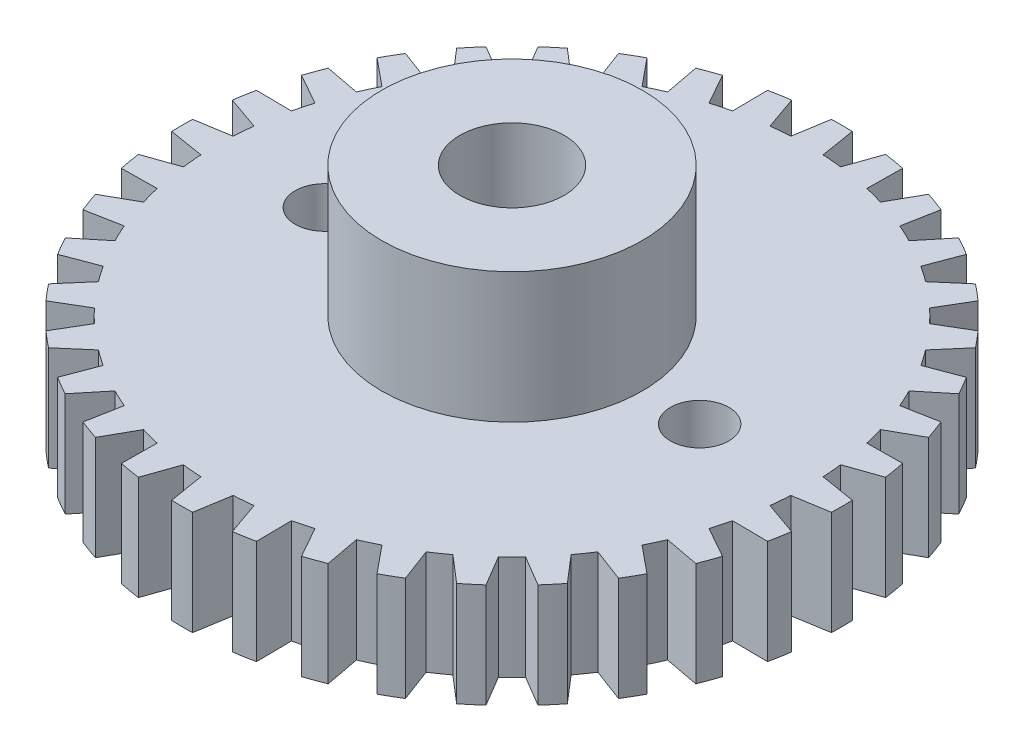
from build123d import *

# Parameters (mm, degrees)
SKETCH1_R           = 3.175
BOSS_EXTRUDE1_DEPTH = 6.35
SKETCH2_R           = 7.9375
SKETCH2_R_2         = 3.175
BOSS_EXTRUDE2_DEPTH = 7.9375
SKETCH3_R           = 1.778
CUT_EXTRUDE1_DEPTH  = 30.518698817


with BuildPart() as part:
    # Sketch1 → Boss-Extrude1 (new body)
    with BuildSketch(Plane(origin=(0, 0, 0), x_dir=(1, 0, 0), z_dir=(0, 1, 0))):
        with BuildLine():
            Line((-0.635, 20.09406907), (-0.984211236, 17.968966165))
            ThreePointArc((-0.984211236, 17.968966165), (-1.568446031, 17.927420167), (-2.151019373, 17.866883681))
            Line((-2.151019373, 17.866883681), (-2.863945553, 19.899061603))
            ThreePointArc((-2.863945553, 19.899061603), (-3.491040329, 19.798673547), (-4.114651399, 19.678528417))
            Line((-4.114651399, 19.678528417), (-4.089537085, 17.525070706))
            ThreePointArc((-4.089537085, 17.525070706), (-4.657681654, 17.382704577), (-5.220892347, 17.221924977))
            Line((-5.220892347, 17.221924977), (-6.275871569, 19.099431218))
            ThreePointArc((-6.275871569, 19.099431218), (-6.876007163, 18.891674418), (-7.469281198, 18.665065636))
            Line((-7.469281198, 18.665065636), (-7.070604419, 16.548684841))
            ThreePointArc((-7.070604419, 16.548684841), (-7.605395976, 16.309824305), (-8.13213115, 16.053686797))
            Line((-8.13213115, 16.053686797), (-9.497108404, 17.71947428))
            ThreePointArc((-9.497108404, 17.71947428), (-10.05205, 17.41066132), (-10.596960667, 17.08447428))
            Line((-10.596960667, 17.08447428), (-9.836835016, 15.069475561))
            ThreePointArc((-9.836835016, 15.069475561), (-10.322024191, 14.741378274), (-10.796279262, 14.397665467))
            Line((-10.796279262, 14.397665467), (-12.429780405, 15.801120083))
            ThreePointArc((-12.429780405, 15.801120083), (-12.922666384, 15.400634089), (-13.402656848, 14.984779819))
            Line((-13.402656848, 14.984779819), (-12.304178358, 13.132387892))
            ThreePointArc((-12.304178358, 13.132387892), (-12.725022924, 12.725022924), (-13.132387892, 12.304178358))
            Line((-13.132387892, 12.304178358), (-14.984779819, 13.402656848))
            ThreePointArc((-14.984779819, 13.402656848), (-15.400634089, 12.922666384), (-15.801120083, 12.429780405))
            Line((-15.801120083, 12.429780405), (-14.397665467, 10.796279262))
            ThreePointArc((-14.397665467, 10.796279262), (-14.741378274, 10.322024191), (-15.069475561, 9.836835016))
            Line((-15.069475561, 9.836835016), (-17.08447428, 10.596960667))
            ThreePointArc((-17.08447428, 10.596960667), (-17.41066132, 10.05205), (-17.71947428, 9.497108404))
            Line((-17.71947428, 9.497108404), (-16.053686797, 8.13213115))
            ThreePointArc((-16.053686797, 8.13213115), (-16.309824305, 7.605395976), (-16.548684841, 7.070604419))
            Line((-16.548684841, 7.070604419), (-18.665065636, 7.469281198))
            ThreePointArc((-18.665065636, 7.469281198), (-18.891674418, 6.876007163), (-19.099431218, 6.275871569))
            Line((-19.099431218, 6.275871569), (-17.221924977, 5.220892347))
            ThreePointArc((-17.221924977, 5.220892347), (-17.382704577, 4.657681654), (-17.525070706, 4.089537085))
            Line((-17.525070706, 4.089537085), (-19.678528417, 4.114651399))
            ThreePointArc((-19.678528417, 4.114651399), (-19.798673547, 3.491040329), (-19.899061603, 2.863945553))
            Line((-19.899061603, 2.863945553), (-17.866883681, 2.151019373))
            ThreePointArc((-17.866883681, 2.151019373), (-17.927420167, 1.568446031), (-17.968966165, 0.984211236))
            Line((-17.968966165, 0.984211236), (-20.09406907, 0.635))
            ThreePointArc((-20.09406907, 0.635), (-20.1041, 0), (-20.09406907, -0.635))
            Line((-20.09406907, -0.635), (-17.968966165, -0.984211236))
            ThreePointArc((-17.968966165, -0.984211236), (-17.927420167, -1.568446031), (-17.866883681, -2.151019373))
            Line((-17.866883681, -2.151019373), (-19.899061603, -2.863945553))
            ThreePointArc((-19.899061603, -2.863945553), (-19.798673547, -3.491040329), (-19.678528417, -4.114651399))
            Line((-19.678528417, -4.114651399), (-17.525070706, -4.089537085))
            ThreePointArc((-17.525070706, -4.089537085), (-17.382704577, -4.657681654), (-17.221924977, -5.220892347))
            Line((-17.221924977, -5.220892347), (-19.099431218, -6.275871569))
            ThreePointArc((-19.099431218, -6.275871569), (-18.891674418, -6.876007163), (-18.665065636, -7.469281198))
            Line((-18.665065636, -7.469281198), (-16.548684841, -7.070604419))
            ThreePointArc((-16.548684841, -7.070604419), (-16.309824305, -7.605395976), (-16.053686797, -8.13213115))
            Line((-16.053686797, -8.13213115), (-17.71947428, -9.497108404))
            ThreePointArc((-17.71947428, -9.497108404), (-17.41066132, -10.05205), (-17.08447428, -10.596960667))
            Line((-17.08447428, -10.596960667), (-15.069475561, -9.836835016))
            ThreePointArc((-15.069475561, -9.836835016), (-14.741378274, -10.322024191), (-14.397665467, -10.796279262))
            Line((-14.397665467, -10.796279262), (-15.801120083, -12.429780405))
            ThreePointArc((-15.801120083, -12.429780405), (-15.400634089, -12.922666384), (-14.984779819, -13.402656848))
            Line((-14.984779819, -13.402656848), (-13.132387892, -12.304178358))
            ThreePointArc((-13.132387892, -12.304178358), (-12.725022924, -12.725022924), (-12.304178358, -13.132387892))
            Line((-12.304178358, -13.132387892), (-13.402656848, -14.984779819))
            ThreePointArc((-13.402656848, -14.984779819), (-12.922666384, -15.400634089), (-12.429780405, -15.801120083))
            Line((-12.429780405, -15.801120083), (-10.796279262, -14.397665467))
            ThreePointArc((-10.796279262, -14.397665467), (-10.322024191, -14.741378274), (-9.836835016, -15.069475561))
            Line((-9.836835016, -15.069475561), (-10.596960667, -17.08447428))
            ThreePointArc((-10.596960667, -17.08447428), (-10.05205, -17.41066132), (-9.497108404, -17.71947428))
            Line((-9.497108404, -17.71947428), (-8.13213115, -16.053686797))
            ThreePointArc((-8.13213115, -16.053686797), (-7.605395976, -16.309824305), (-7.070604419, -16.548684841))
            Line((-7.070604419, -16.548684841), (-7.469281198, -18.665065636))
            ThreePointArc((-7.469281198, -18.665065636), (-6.876007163, -18.891674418), (-6.275871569, -19.099431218))
            Line((-6.275871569, -19.099431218), (-5.220892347, -17.221924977))
            ThreePointArc((-5.220892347, -17.221924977), (-4.657681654, -17.382704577), (-4.089537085, -17.525070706))
            Line((-4.089537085, -17.525070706), (-4.114651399, -19.678528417))
            ThreePointArc((-4.114651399, -19.678528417), (-3.491040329, -19.798673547), (-2.863945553, -19.899061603))
            Line((-2.863945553, -19.899061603), (-2.151019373, -17.866883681))
            ThreePointArc((-2.151019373, -17.866883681), (-1.568446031, -17.927420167), (-0.984211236, -17.968966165))
            Line((-0.984211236, -17.968966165), (-0.635, -20.09406907))
            ThreePointArc((-0.635, -20.09406907), (0, -20.1041), (0.635, -20.09406907))
            Line((0.635, -20.09406907), (0.984211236, -17.968966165))
            ThreePointArc((0.984211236, -17.968966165), (1.568446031, -17.927420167), (2.151019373, -17.866883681))
            Line((2.151019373, -17.866883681), (2.863945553, -19.899061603))
            ThreePointArc((2.863945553, -19.899061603), (3.491040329, -19.798673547), (4.114651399, -19.678528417))
            Line((4.114651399, -19.678528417), (4.089537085, -17.525070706))
            ThreePointArc((4.089537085, -17.525070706), (4.657681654, -17.382704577), (5.220892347, -17.221924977))
            Line((5.220892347, -17.221924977), (6.275871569, -19.099431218))
            ThreePointArc((6.275871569, -19.099431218), (6.876007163, -18.891674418), (7.469281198, -18.665065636))
            Line((7.469281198, -18.665065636), (7.070604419, -16.548684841))
            ThreePointArc((7.070604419, -16.548684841), (7.605395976, -16.309824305), (8.13213115, -16.053686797))
            Line((8.13213115, -16.053686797), (9.497108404, -17.71947428))
            ThreePointArc((9.497108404, -17.71947428), (10.05205, -17.41066132), (10.596960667, -17.08447428))
            Line((10.596960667, -17.08447428), (9.836835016, -15.069475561))
            ThreePointArc((9.836835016, -15.069475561), (10.322024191, -14.741378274), (10.796279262, -14.397665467))
            Line((10.796279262, -14.397665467), (12.429780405, -15.801120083))
            ThreePointArc((12.429780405, -15.801120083), (12.922666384, -15.400634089), (13.402656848, -14.984779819))
            Line((13.402656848, -14.984779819), (12.304178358, -13.132387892))
            ThreePointArc((12.304178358, -13.132387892), (12.725022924, -12.725022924), (13.132387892, -12.304178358))
            Line((13.132387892, -12.304178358), (14.984779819, -13.402656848))
            ThreePointArc((14.984779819, -13.402656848), (15.400634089, -12.922666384), (15.801120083, -12.429780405))
            Line((15.801120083, -12.429780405), (14.397665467, -10.796279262))
            ThreePointArc((14.397665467, -10.796279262), (14.741378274, -10.322024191), (15.069475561, -9.836835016))
            Line((15.069475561, -9.836835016), (17.08447428, -10.596960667))
            ThreePointArc((17.08447428, -10.596960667), (17.41066132, -10.05205), (17.71947428, -9.497108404))
            Line((17.71947428, -9.497108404), (16.053686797, -8.13213115))
            ThreePointArc((16.053686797, -8.13213115), (16.309824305, -7.605395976), (16.548684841, -7.070604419))
            Line((16.548684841, -7.070604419), (18.665065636, -7.469281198))
            ThreePointArc((18.665065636, -7.469281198), (18.891674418, -6.876007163), (19.099431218, -6.275871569))
            Line((19.099431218, -6.275871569), (17.221924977, -5.220892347))
            ThreePointArc((17.221924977, -5.220892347), (17.382704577, -4.657681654), (17.525070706, -4.089537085))
            Line((17.525070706, -4.089537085), (19.678528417, -4.114651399))
            ThreePointArc((19.678528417, -4.114651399), (19.798673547, -3.491040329), (19.899061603, -2.863945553))
            Line((19.899061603, -2.863945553), (17.866883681, -2.151019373))
            ThreePointArc((17.866883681, -2.151019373), (17.927420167, -1.568446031), (17.968966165, -0.984211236))
            Line((17.968966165, -0.984211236), (20.09406907, -0.635))
            ThreePointArc((20.09406907, -0.635), (20.1041, 0), (20.09406907, 0.635))
            Line((20.09406907, 0.635), (17.968966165, 0.984211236))
            ThreePointArc((17.968966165, 0.984211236), (17.927420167, 1.568446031), (17.866883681, 2.151019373))
            Line((17.866883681, 2.151019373), (19.899061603, 2.863945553))
            ThreePointArc((19.899061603, 2.863945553), (19.798673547, 3.491040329), (19.678528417, 4.114651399))
            Line((19.678528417, 4.114651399), (17.525070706, 4.089537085))
            ThreePointArc((17.525070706, 4.089537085), (17.382704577, 4.657681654), (17.221924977, 5.220892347))
            Line((17.221924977, 5.220892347), (19.099431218, 6.275871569))
            ThreePointArc((19.099431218, 6.275871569), (18.891674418, 6.876007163), (18.665065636, 7.469281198))
            Line((18.665065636, 7.469281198), (16.548684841, 7.070604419))
            ThreePointArc((16.548684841, 7.070604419), (16.309824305, 7.605395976), (16.053686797, 8.13213115))
            Line((16.053686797, 8.13213115), (17.71947428, 9.497108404))
            ThreePointArc((17.71947428, 9.497108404), (17.41066132, 10.05205), (17.08447428, 10.596960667))
            Line((17.08447428, 10.596960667), (15.069475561, 9.836835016))
            ThreePointArc((15.069475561, 9.836835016), (14.741378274, 10.322024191), (14.397665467, 10.796279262))
            Line((14.397665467, 10.796279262), (15.801120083, 12.429780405))
            ThreePointArc((15.801120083, 12.429780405), (15.400634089, 12.922666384), (14.984779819, 13.402656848))
            Line((14.984779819, 13.402656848), (13.132387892, 12.304178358))
            ThreePointArc((13.132387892, 12.304178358), (12.725022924, 12.725022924), (12.304178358, 13.132387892))
            Line((12.304178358, 13.132387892), (13.402656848, 14.984779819))
            ThreePointArc((13.402656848, 14.984779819), (12.922666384, 15.400634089), (12.429780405, 15.801120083))
            Line((12.429780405, 15.801120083), (10.796279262, 14.397665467))
            ThreePointArc((10.796279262, 14.397665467), (10.322024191, 14.741378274), (9.836835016, 15.069475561))
            Line((9.836835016, 15.069475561), (10.596960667, 17.08447428))
            ThreePointArc((10.596960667, 17.08447428), (10.05205, 17.41066132), (9.497108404, 17.71947428))
            Line((9.497108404, 17.71947428), (8.13213115, 16.053686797))
            ThreePointArc((8.13213115, 16.053686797), (7.605395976, 16.309824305), (7.070604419, 16.548684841))
            Line((7.070604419, 16.548684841), (7.469281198, 18.665065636))
            ThreePointArc((7.469281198, 18.665065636), (6.876007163, 18.891674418), (6.275871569, 19.099431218))
            Line((6.275871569, 19.099431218), (5.220892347, 17.221924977))
            ThreePointArc((5.220892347, 17.221924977), (4.657681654, 17.382704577), (4.089537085, 17.525070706))
            Line((4.089537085, 17.525070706), (4.114651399, 19.678528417))
            ThreePointArc((4.114651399, 19.678528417), (3.491040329, 19.798673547), (2.863945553, 19.899061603))
            Line((2.863945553, 19.899061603), (2.151019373, 17.866883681))
            ThreePointArc((2.151019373, 17.866883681), (1.568446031, 17.927420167), (0.984211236, 17.968966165))
            Line((0.984211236, 17.968966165), (0.635, 20.09406907))
            ThreePointArc((0.635, 20.09406907), (0, 20.1041), (-0.635, 20.09406907))
        make_face()
        with Locations(Location((0, 0, 0), (0, 0, 270))):
            Circle(SKETCH1_R, mode=Mode.SUBTRACT)
    extrude(amount=BOSS_EXTRUDE1_DEPTH)

    # Sketch2 → Boss-Extrude2 (add)
    with BuildSketch(Plane(origin=(0, 6.35, 0), x_dir=(1, 0, 0), z_dir=(0, 1, 0))):
        with Locations(Location((0, 0, 0), (0, 0, 90))):
            Circle(SKETCH2_R)
        with Locations(Location((0, 0, 0), (0, 0, 270))):
            Circle(SKETCH2_R_2, mode=Mode.SUBTRACT)
    extrude(amount=BOSS_EXTRUDE2_DEPTH)

    # Sketch3 → Cut-Extrude1 (cut, through all)
    with BuildSketch(Plane(origin=(0, 6.35, 0), x_dir=(1, 0, 0), z_dir=(0, 1, 0))):
        with Locations(Location((11.43, 0, 0), (0, 0, 270))):
            Circle(SKETCH3_R)
        with Locations(Location((-11.43, 0, 0), (0, 0, 270))):
            Circle(SKETCH3_R)
    extrude(amount=-CUT_EXTRUDE1_DEPTH, mode=Mode.SUBTRACT)


solid = part.part
